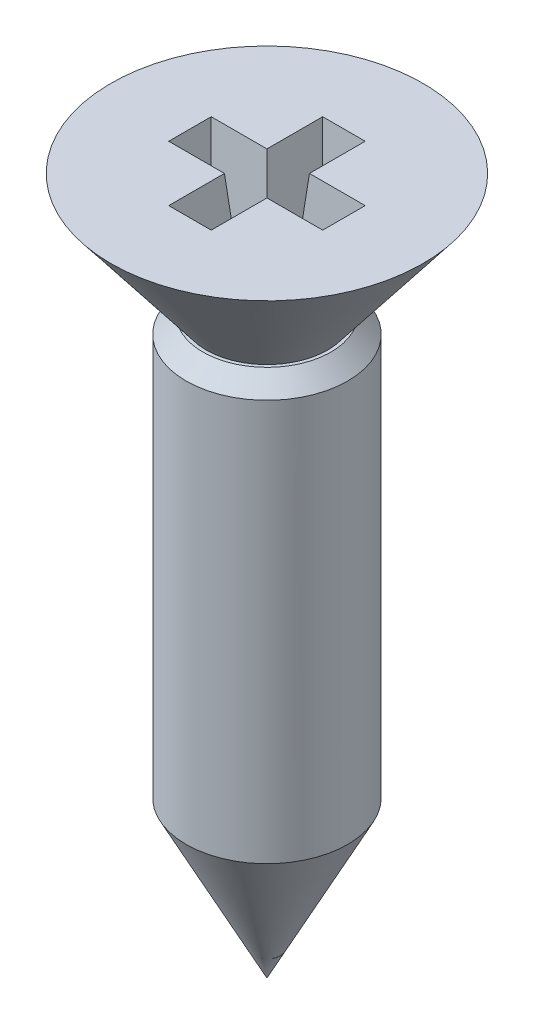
ISO-10303-21;
HEADER;
FILE_DESCRIPTION(('STEP AP214'),'2;1');
FILE_NAME('part.step','',(''),(''),'','','');
FILE_SCHEMA(('AUTOMOTIVE_DESIGN { 1 0 10303 214 1 1 1 1 }'));
ENDSEC;
DATA;
#1=APPLICATION_CONTEXT('core data for automotive mechanical design processes');
#2=APPLICATION_PROTOCOL_DEFINITION('international standard','automotive_design',2000,#1);
#3=PRODUCT_CONTEXT('',#1,'mechanical');
#4=PRODUCT('Part','Part','',(#3));
#5=PRODUCT_RELATED_PRODUCT_CATEGORY('part','',(#4));
#6=PRODUCT_DEFINITION_FORMATION('','',#4);
#7=PRODUCT_DEFINITION_CONTEXT('part definition',#1,'design');
#8=PRODUCT_DEFINITION('design','',#6,#7);
#9=PRODUCT_DEFINITION_SHAPE('','',#8);
#10=(LENGTH_UNIT() NAMED_UNIT(*) SI_UNIT(.MILLI.,.METRE.));
#11=(NAMED_UNIT(*) PLANE_ANGLE_UNIT() SI_UNIT($,.RADIAN.));
#12=(NAMED_UNIT(*) SI_UNIT($,.STERADIAN.) SOLID_ANGLE_UNIT());
#13=UNCERTAINTY_MEASURE_WITH_UNIT(LENGTH_MEASURE(1.E-05),#10,'distance_accuracy_value','');
#14=(GEOMETRIC_REPRESENTATION_CONTEXT(3) GLOBAL_UNCERTAINTY_ASSIGNED_CONTEXT((#13)) GLOBAL_UNIT_ASSIGNED_CONTEXT((#10,
#11,#12)) REPRESENTATION_CONTEXT('',''));
#15=CARTESIAN_POINT('',(0.,0.,0.));
#16=DIRECTION('',(0.,0.,1.));
#17=DIRECTION('',(1.,0.,0.));
#18=AXIS2_PLACEMENT_3D('',#15,#16,#17);
#19=CARTESIAN_POINT('',(0.,-15.9482396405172,0.));
#20=DIRECTION('',(0.,1.,0.));
#21=DIRECTION('',(0.,0.,1.));
#22=AXIS2_PLACEMENT_3D('',#19,#20,#21);
#23=CONICAL_SURFACE('',#22,0.,0.477831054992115);
#24=CARTESIAN_POINT('',(0.,-13.1482396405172,0.));
#25=DIRECTION('',(0.,1.,0.));
#26=DIRECTION('',(0.,0.,1.));
#27=AXIS2_PLACEMENT_3D('',#24,#25,#26);
#28=CIRCLE('',#27,1.45);
#29=CARTESIAN_POINT('',(0.,-13.1482396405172,1.45));
#30=VERTEX_POINT('',#29);
#31=EDGE_CURVE('E192',#30,#30,#28,.T.);
#32=ORIENTED_EDGE('',*,*,#31,.F.);
#33=EDGE_LOOP('',(#32));
#34=FACE_BOUND('',#33,.T.);
#35=CARTESIAN_POINT('',(0.,-15.9482396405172,0.));
#36=VERTEX_POINT('',#35);
#37=VERTEX_LOOP('',#36);
#38=FACE_BOUND('',#37,.T.);
#39=ADVANCED_FACE('F26',(#34,#38),#23,.T.);
#40=CARTESIAN_POINT('',(0.,0.,0.));
#41=DIRECTION('',(0.,1.,0.));
#42=DIRECTION('',(0.,0.,1.));
#43=AXIS2_PLACEMENT_3D('',#40,#41,#42);
#44=CYLINDRICAL_SURFACE('',#43,1.45);
#45=CARTESIAN_POINT('',(0.,-5.94823964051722,0.));
#46=DIRECTION('',(0.,-1.,0.));
#47=DIRECTION('',(0.,0.,-1.));
#48=AXIS2_PLACEMENT_3D('',#45,#46,#47);
#49=CIRCLE('',#48,1.45);
#50=CARTESIAN_POINT('',(0.,-5.94823964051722,-1.45));
#51=VERTEX_POINT('',#50);
#52=EDGE_CURVE('E11',#51,#51,#49,.T.);
#53=ORIENTED_EDGE('',*,*,#52,.T.);
#54=EDGE_LOOP('',(#53));
#55=FACE_BOUND('',#54,.T.);
#56=ORIENTED_EDGE('',*,*,#31,.T.);
#57=EDGE_LOOP('',(#56));
#58=FACE_BOUND('',#57,.T.);
#59=ADVANCED_FACE('F276',(#55,#58),#44,.T.);
#60=CARTESIAN_POINT('',(1.09,-5.64823964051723,0.));
#61=DIRECTION('',(0.,-1.,0.));
#62=DIRECTION('',(0.,0.,-1.));
#63=AXIS2_PLACEMENT_3D('',#60,#61,#62);
#64=PLANE('',#63);
#65=CARTESIAN_POINT('',(0.,-5.64823964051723,0.));
#66=DIRECTION('',(0.,-1.,0.));
#67=DIRECTION('',(0.,0.,-1.));
#68=AXIS2_PLACEMENT_3D('',#65,#66,#67);
#69=CIRCLE('',#68,1.15000000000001);
#70=CARTESIAN_POINT('',(0.,-5.64823964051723,-1.15000000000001));
#71=VERTEX_POINT('',#70);
#72=EDGE_CURVE('E36',#71,#71,#69,.F.);
#73=ORIENTED_EDGE('',*,*,#72,.T.);
#74=EDGE_LOOP('',(#73));
#75=FACE_BOUND('',#74,.T.);
#76=CARTESIAN_POINT('',(0.,-5.64823964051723,0.));
#77=DIRECTION('',(0.,1.,0.));
#78=DIRECTION('',(0.,0.,1.));
#79=AXIS2_PLACEMENT_3D('',#76,#77,#78);
#80=CIRCLE('',#79,1.09);
#81=CARTESIAN_POINT('',(0.,-5.64823964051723,1.09));
#82=VERTEX_POINT('',#81);
#83=EDGE_CURVE('E195',#82,#82,#80,.T.);
#84=ORIENTED_EDGE('',*,*,#83,.F.);
#85=EDGE_LOOP('',(#84));
#86=FACE_BOUND('',#85,.T.);
#87=ADVANCED_FACE('F283',(#75,#86),#64,.F.);
#88=CARTESIAN_POINT('',(0.,-5.64823964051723,0.));
#89=DIRECTION('',(0.,1.,0.));
#90=DIRECTION('',(0.,0.,1.));
#91=AXIS2_PLACEMENT_3D('',#88,#89,#90);
#92=CONICAL_SURFACE('',#91,1.09,0.66072840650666);
#93=CARTESIAN_POINT('',(0.,-3.44823964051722,0.));
#94=DIRECTION('',(0.,1.,0.));
#95=DIRECTION('',(0.,0.,1.));
#96=AXIS2_PLACEMENT_3D('',#93,#94,#95);
#97=CIRCLE('',#96,2.8);
#98=CARTESIAN_POINT('',(0.,-3.44823964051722,2.8));
#99=VERTEX_POINT('',#98);
#100=EDGE_CURVE('E182',#99,#99,#97,.T.);
#101=ORIENTED_EDGE('',*,*,#100,.F.);
#102=EDGE_LOOP('',(#101));
#103=FACE_BOUND('',#102,.T.);
#104=ORIENTED_EDGE('',*,*,#83,.T.);
#105=EDGE_LOOP('',(#104));
#106=FACE_BOUND('',#105,.T.);
#107=ADVANCED_FACE('F347',(#103,#106),#92,.T.);
#108=CARTESIAN_POINT('',(0.,-3.44823964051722,0.));
#109=DIRECTION('',(0.,-1.,0.));
#110=DIRECTION('',(0.,0.,-1.));
#111=AXIS2_PLACEMENT_3D('',#108,#109,#110);
#112=PLANE('',#111);
#113=DIRECTION('',(1.,0.,0.));
#114=VECTOR('',#113,1.);
#115=CARTESIAN_POINT('',(-1.25,-3.44823964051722,-0.381232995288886));
#116=LINE('',#115,#114);
#117=CARTESIAN_POINT('',(-0.381232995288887,-3.44823964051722,-0.381232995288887));
#118=VERTEX_POINT('',#117);
#119=CARTESIAN_POINT('',(-1.38123299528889,-3.44823964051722,-0.381232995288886));
#120=VERTEX_POINT('',#119);
#121=EDGE_CURVE('E121',#118,#120,#116,.F.);
#122=ORIENTED_EDGE('',*,*,#121,.F.);
#123=DIRECTION('',(0.,0.,-1.));
#124=VECTOR('',#123,1.);
#125=CARTESIAN_POINT('',(-0.381232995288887,-3.44823964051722,-0.250000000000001));
#126=LINE('',#125,#124);
#127=CARTESIAN_POINT('',(-0.381232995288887,-3.44823964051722,-1.38123299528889));
#128=VERTEX_POINT('',#127);
#129=EDGE_CURVE('E45',#128,#118,#126,.F.);
#130=ORIENTED_EDGE('',*,*,#129,.F.);
#131=DIRECTION('',(1.,0.,0.));
#132=VECTOR('',#131,1.);
#133=CARTESIAN_POINT('',(-0.250000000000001,-3.44823964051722,-1.38123299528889));
#134=LINE('',#133,#132);
#135=CARTESIAN_POINT('',(0.381232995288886,-3.44823964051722,-1.38123299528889));
#136=VERTEX_POINT('',#135);
#137=EDGE_CURVE('E134',#136,#128,#134,.F.);
#138=ORIENTED_EDGE('',*,*,#137,.F.);
#139=DIRECTION('',(0.,0.,1.));
#140=VECTOR('',#139,1.);
#141=CARTESIAN_POINT('',(0.381232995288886,-3.44823964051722,-1.25));
#142=LINE('',#141,#140);
#143=CARTESIAN_POINT('',(0.381232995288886,-3.44823964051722,-0.381232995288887));
#144=VERTEX_POINT('',#143);
#145=EDGE_CURVE('E138',#144,#136,#142,.F.);
#146=ORIENTED_EDGE('',*,*,#145,.F.);
#147=DIRECTION('',(1.,0.,0.));
#148=VECTOR('',#147,1.);
#149=CARTESIAN_POINT('',(0.249999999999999,-3.44823964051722,-0.381232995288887));
#150=LINE('',#149,#148);
#151=CARTESIAN_POINT('',(1.38123299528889,-3.44823964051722,-0.381232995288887));
#152=VERTEX_POINT('',#151);
#153=EDGE_CURVE('E141',#152,#144,#150,.F.);
#154=ORIENTED_EDGE('',*,*,#153,.F.);
#155=DIRECTION('',(0.,0.,1.));
#156=VECTOR('',#155,1.);
#157=CARTESIAN_POINT('',(1.38123299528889,-3.44823964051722,-0.250000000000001));
#158=LINE('',#157,#156);
#159=CARTESIAN_POINT('',(1.38123299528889,-3.44823964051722,0.381232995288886));
#160=VERTEX_POINT('',#159);
#161=EDGE_CURVE('E143',#160,#152,#158,.F.);
#162=ORIENTED_EDGE('',*,*,#161,.F.);
#163=DIRECTION('',(-1.,0.,0.));
#164=VECTOR('',#163,1.);
#165=CARTESIAN_POINT('',(1.25,-3.44823964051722,0.381232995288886));
#166=LINE('',#165,#164);
#167=CARTESIAN_POINT('',(0.381232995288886,-3.44823964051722,0.381232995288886));
#168=VERTEX_POINT('',#167);
#169=EDGE_CURVE('E30',#168,#160,#166,.F.);
#170=ORIENTED_EDGE('',*,*,#169,.F.);
#171=DIRECTION('',(0.,0.,1.));
#172=VECTOR('',#171,1.);
#173=CARTESIAN_POINT('',(0.381232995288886,-3.44823964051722,0.25));
#174=LINE('',#173,#172);
#175=CARTESIAN_POINT('',(0.381232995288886,-3.44823964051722,1.38123299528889));
#176=VERTEX_POINT('',#175);
#177=EDGE_CURVE('E147',#176,#168,#174,.F.);
#178=ORIENTED_EDGE('',*,*,#177,.F.);
#179=DIRECTION('',(-1.,0.,0.));
#180=VECTOR('',#179,1.);
#181=CARTESIAN_POINT('',(0.25,-3.44823964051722,1.38123299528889));
#182=LINE('',#181,#180);
#183=CARTESIAN_POINT('',(-0.381232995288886,-3.44823964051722,1.38123299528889));
#184=VERTEX_POINT('',#183);
#185=EDGE_CURVE('E149',#184,#176,#182,.F.);
#186=ORIENTED_EDGE('',*,*,#185,.F.);
#187=DIRECTION('',(0.,0.,-1.));
#188=VECTOR('',#187,1.);
#189=CARTESIAN_POINT('',(-0.381232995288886,-3.44823964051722,1.25));
#190=LINE('',#189,#188);
#191=CARTESIAN_POINT('',(-0.381232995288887,-3.44823964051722,0.381232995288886));
#192=VERTEX_POINT('',#191);
#193=EDGE_CURVE('E129',#192,#184,#190,.F.);
#194=ORIENTED_EDGE('',*,*,#193,.F.);
#195=DIRECTION('',(-1.,0.,0.));
#196=VECTOR('',#195,1.);
#197=CARTESIAN_POINT('',(-0.25,-3.44823964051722,0.381232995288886));
#198=LINE('',#197,#196);
#199=CARTESIAN_POINT('',(-1.38123299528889,-3.44823964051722,0.381232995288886));
#200=VERTEX_POINT('',#199);
#201=EDGE_CURVE('E127',#200,#192,#198,.F.);
#202=ORIENTED_EDGE('',*,*,#201,.F.);
#203=DIRECTION('',(0.,0.,-1.));
#204=VECTOR('',#203,1.);
#205=CARTESIAN_POINT('',(-1.38123299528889,-3.44823964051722,0.25));
#206=LINE('',#205,#204);
#207=EDGE_CURVE('E110',#120,#200,#206,.F.);
#208=ORIENTED_EDGE('',*,*,#207,.F.);
#209=EDGE_LOOP('',(#122,#130,#138,#146,#154,#162,#170,#178,#186,#194,#202,#208));
#210=FACE_BOUND('',#209,.T.);
#211=ORIENTED_EDGE('',*,*,#100,.T.);
#212=EDGE_LOOP('',(#211));
#213=FACE_BOUND('',#212,.T.);
#214=ADVANCED_FACE('F124',(#210,#213),#112,.F.);
#215=CARTESIAN_POINT('',(0.,-5.64823964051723,0.));
#216=DIRECTION('',(0.,-1.,0.));
#217=DIRECTION('',(0.,0.,-1.));
#218=AXIS2_PLACEMENT_3D('',#215,#216,#217);
#219=CONICAL_SURFACE('',#218,1.15000000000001,0.785398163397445);
#220=ORIENTED_EDGE('',*,*,#52,.F.);
#221=EDGE_LOOP('',(#220));
#222=FACE_BOUND('',#221,.T.);
#223=ORIENTED_EDGE('',*,*,#72,.F.);
#224=EDGE_LOOP('',(#223));
#225=FACE_BOUND('',#224,.T.);
#226=ADVANCED_FACE('F272',(#222,#225),#219,.T.);
#227=CARTESIAN_POINT('',(-0.25,-4.94823964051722,-0.250000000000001));
#228=DIRECTION('',(0.996194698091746,0.0871557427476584,0.));
#229=DIRECTION('',(-0.0871557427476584,0.996194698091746,0.));
#230=AXIS2_PLACEMENT_3D('',#227,#228,#229);
#231=PLANE('',#230);
#232=ORIENTED_EDGE('',*,*,#129,.T.);
#233=DIRECTION('',(-0.0868265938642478,0.992432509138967,-0.0868265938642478));
#234=VECTOR('',#233,1.);
#235=CARTESIAN_POINT('',(-0.257538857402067,-4.86207010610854,-0.257538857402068));
#236=LINE('',#235,#234);
#237=CARTESIAN_POINT('',(-0.25,-4.94823964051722,-0.250000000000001));
#238=VERTEX_POINT('',#237);
#239=EDGE_CURVE('E118',#238,#118,#236,.T.);
#240=ORIENTED_EDGE('',*,*,#239,.F.);
#241=DIRECTION('',(0.,0.,1.));
#242=VECTOR('',#241,1.);
#243=CARTESIAN_POINT('',(-0.25,-4.94823964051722,-0.250000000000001));
#244=LINE('',#243,#242);
#245=CARTESIAN_POINT('',(-0.250000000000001,-4.94823964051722,-1.25));
#246=VERTEX_POINT('',#245);
#247=EDGE_CURVE('E137',#246,#238,#244,.T.);
#248=ORIENTED_EDGE('',*,*,#247,.F.);
#249=DIRECTION('',(-0.0868265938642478,0.992432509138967,-0.0868265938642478));
#250=VECTOR('',#249,1.);
#251=CARTESIAN_POINT('',(-0.250000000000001,-4.94823964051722,-1.25));
#252=LINE('',#251,#250);
#253=EDGE_CURVE('E180',#246,#128,#252,.T.);
#254=ORIENTED_EDGE('',*,*,#253,.T.);
#255=EDGE_LOOP('',(#232,#240,#248,#254));
#256=FACE_BOUND('',#255,.T.);
#257=ADVANCED_FACE('F232',(#256),#231,.T.);
#258=CARTESIAN_POINT('',(-0.250000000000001,-4.94823964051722,-1.25));
#259=DIRECTION('',(0.,0.0871557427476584,0.996194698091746));
#260=DIRECTION('',(0.,-0.996194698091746,0.0871557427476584));
#261=AXIS2_PLACEMENT_3D('',#258,#259,#260);
#262=PLANE('',#261);
#263=ORIENTED_EDGE('',*,*,#137,.T.);
#264=ORIENTED_EDGE('',*,*,#253,.F.);
#265=DIRECTION('',(-1.,0.,0.));
#266=VECTOR('',#265,1.);
#267=CARTESIAN_POINT('',(-0.250000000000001,-4.94823964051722,-1.25));
#268=LINE('',#267,#266);
#269=CARTESIAN_POINT('',(0.249999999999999,-4.94823964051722,-1.25));
#270=VERTEX_POINT('',#269);
#271=EDGE_CURVE('E179',#270,#246,#268,.T.);
#272=ORIENTED_EDGE('',*,*,#271,.F.);
#273=DIRECTION('',(0.0868265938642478,0.992432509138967,-0.0868265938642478));
#274=VECTOR('',#273,1.);
#275=CARTESIAN_POINT('',(0.249999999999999,-4.94823964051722,-1.25));
#276=LINE('',#275,#274);
#277=EDGE_CURVE('E183',#270,#136,#276,.T.);
#278=ORIENTED_EDGE('',*,*,#277,.T.);
#279=EDGE_LOOP('',(#263,#264,#272,#278));
#280=FACE_BOUND('',#279,.T.);
#281=ADVANCED_FACE('F264',(#280),#262,.T.);
#282=CARTESIAN_POINT('',(0.249999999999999,-4.94823964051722,-1.25));
#283=DIRECTION('',(-0.996194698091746,0.0871557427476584,0.));
#284=DIRECTION('',(-0.0871557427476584,-0.996194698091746,0.));
#285=AXIS2_PLACEMENT_3D('',#282,#283,#284);
#286=PLANE('',#285);
#287=ORIENTED_EDGE('',*,*,#145,.T.);
#288=ORIENTED_EDGE('',*,*,#277,.F.);
#289=DIRECTION('',(0.,0.,-1.));
#290=VECTOR('',#289,1.);
#291=CARTESIAN_POINT('',(0.249999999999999,-4.94823964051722,-1.25));
#292=LINE('',#291,#290);
#293=CARTESIAN_POINT('',(0.249999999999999,-4.94823964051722,-0.250000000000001));
#294=VERTEX_POINT('',#293);
#295=EDGE_CURVE('E202',#294,#270,#292,.T.);
#296=ORIENTED_EDGE('',*,*,#295,.F.);
#297=DIRECTION('',(0.0868265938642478,0.992432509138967,-0.0868265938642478));
#298=VECTOR('',#297,1.);
#299=CARTESIAN_POINT('',(0.257538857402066,-4.86207010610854,-0.257538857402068));
#300=LINE('',#299,#298);
#301=EDGE_CURVE('E185',#294,#144,#300,.T.);
#302=ORIENTED_EDGE('',*,*,#301,.T.);
#303=EDGE_LOOP('',(#287,#288,#296,#302));
#304=FACE_BOUND('',#303,.T.);
#305=ADVANCED_FACE('F262',(#304),#286,.T.);
#306=CARTESIAN_POINT('',(0.249999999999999,-4.94823964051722,-0.250000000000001));
#307=DIRECTION('',(0.,0.0871557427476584,0.996194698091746));
#308=DIRECTION('',(0.,-0.996194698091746,0.0871557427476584));
#309=AXIS2_PLACEMENT_3D('',#306,#307,#308);
#310=PLANE('',#309);
#311=ORIENTED_EDGE('',*,*,#153,.T.);
#312=ORIENTED_EDGE('',*,*,#301,.F.);
#313=DIRECTION('',(-1.,0.,0.));
#314=VECTOR('',#313,1.);
#315=CARTESIAN_POINT('',(0.249999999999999,-4.94823964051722,-0.250000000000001));
#316=LINE('',#315,#314);
#317=CARTESIAN_POINT('',(1.25,-4.94823964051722,-0.250000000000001));
#318=VERTEX_POINT('',#317);
#319=EDGE_CURVE('E205',#318,#294,#316,.T.);
#320=ORIENTED_EDGE('',*,*,#319,.F.);
#321=DIRECTION('',(0.0868265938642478,0.992432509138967,-0.0868265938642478));
#322=VECTOR('',#321,1.);
#323=CARTESIAN_POINT('',(1.25,-4.94823964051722,-0.250000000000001));
#324=LINE('',#323,#322);
#325=EDGE_CURVE('E186',#318,#152,#324,.T.);
#326=ORIENTED_EDGE('',*,*,#325,.T.);
#327=EDGE_LOOP('',(#311,#312,#320,#326));
#328=FACE_BOUND('',#327,.T.);
#329=ADVANCED_FACE('F259',(#328),#310,.T.);
#330=CARTESIAN_POINT('',(1.25,-4.94823964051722,-0.250000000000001));
#331=DIRECTION('',(-0.996194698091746,0.0871557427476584,0.));
#332=DIRECTION('',(-0.0871557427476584,-0.996194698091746,0.));
#333=AXIS2_PLACEMENT_3D('',#330,#331,#332);
#334=PLANE('',#333);
#335=ORIENTED_EDGE('',*,*,#161,.T.);
#336=ORIENTED_EDGE('',*,*,#325,.F.);
#337=DIRECTION('',(0.,0.,-1.));
#338=VECTOR('',#337,1.);
#339=CARTESIAN_POINT('',(1.25,-4.94823964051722,-0.250000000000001));
#340=LINE('',#339,#338);
#341=CARTESIAN_POINT('',(1.25,-4.94823964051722,0.249999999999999));
#342=VERTEX_POINT('',#341);
#343=EDGE_CURVE('E208',#342,#318,#340,.T.);
#344=ORIENTED_EDGE('',*,*,#343,.F.);
#345=DIRECTION('',(0.0868265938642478,0.992432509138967,0.0868265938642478));
#346=VECTOR('',#345,1.);
#347=CARTESIAN_POINT('',(1.25,-4.94823964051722,0.249999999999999));
#348=LINE('',#347,#346);
#349=EDGE_CURVE('E71',#342,#160,#348,.T.);
#350=ORIENTED_EDGE('',*,*,#349,.T.);
#351=EDGE_LOOP('',(#335,#336,#344,#350));
#352=FACE_BOUND('',#351,.T.);
#353=ADVANCED_FACE('F257',(#352),#334,.T.);
#354=CARTESIAN_POINT('',(1.25,-4.94823964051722,0.249999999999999));
#355=DIRECTION('',(0.,0.0871557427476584,-0.996194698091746));
#356=DIRECTION('',(0.,0.996194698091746,0.0871557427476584));
#357=AXIS2_PLACEMENT_3D('',#354,#355,#356);
#358=PLANE('',#357);
#359=ORIENTED_EDGE('',*,*,#169,.T.);
#360=ORIENTED_EDGE('',*,*,#349,.F.);
#361=DIRECTION('',(1.,0.,0.));
#362=VECTOR('',#361,1.);
#363=CARTESIAN_POINT('',(1.25,-4.94823964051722,0.249999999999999));
#364=LINE('',#363,#362);
#365=CARTESIAN_POINT('',(0.25,-4.94823964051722,0.25));
#366=VERTEX_POINT('',#365);
#367=EDGE_CURVE('E211',#366,#342,#364,.T.);
#368=ORIENTED_EDGE('',*,*,#367,.F.);
#369=DIRECTION('',(0.0868265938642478,0.992432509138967,0.0868265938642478));
#370=VECTOR('',#369,1.);
#371=CARTESIAN_POINT('',(0.257538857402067,-4.86207010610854,0.257538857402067));
#372=LINE('',#371,#370);
#373=EDGE_CURVE('E78',#366,#168,#372,.T.);
#374=ORIENTED_EDGE('',*,*,#373,.T.);
#375=EDGE_LOOP('',(#359,#360,#368,#374));
#376=FACE_BOUND('',#375,.T.);
#377=ADVANCED_FACE('F256',(#376),#358,.T.);
#378=CARTESIAN_POINT('',(0.25,-4.94823964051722,0.25));
#379=DIRECTION('',(-0.996194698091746,0.0871557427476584,0.));
#380=DIRECTION('',(-0.0871557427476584,-0.996194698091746,0.));
#381=AXIS2_PLACEMENT_3D('',#378,#379,#380);
#382=PLANE('',#381);
#383=ORIENTED_EDGE('',*,*,#177,.T.);
#384=ORIENTED_EDGE('',*,*,#373,.F.);
#385=DIRECTION('',(0.,0.,-1.));
#386=VECTOR('',#385,1.);
#387=CARTESIAN_POINT('',(0.25,-4.94823964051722,0.25));
#388=LINE('',#387,#386);
#389=CARTESIAN_POINT('',(0.25,-4.94823964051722,1.25));
#390=VERTEX_POINT('',#389);
#391=EDGE_CURVE('E214',#390,#366,#388,.T.);
#392=ORIENTED_EDGE('',*,*,#391,.F.);
#393=DIRECTION('',(0.0868265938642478,0.992432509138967,0.0868265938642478));
#394=VECTOR('',#393,1.);
#395=CARTESIAN_POINT('',(0.25,-4.94823964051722,1.25));
#396=LINE('',#395,#394);
#397=EDGE_CURVE('E86',#390,#176,#396,.T.);
#398=ORIENTED_EDGE('',*,*,#397,.T.);
#399=EDGE_LOOP('',(#383,#384,#392,#398));
#400=FACE_BOUND('',#399,.T.);
#401=ADVANCED_FACE('F255',(#400),#382,.T.);
#402=CARTESIAN_POINT('',(0.25,-4.94823964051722,1.25));
#403=DIRECTION('',(0.,0.0871557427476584,-0.996194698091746));
#404=DIRECTION('',(0.,0.996194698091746,0.0871557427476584));
#405=AXIS2_PLACEMENT_3D('',#402,#403,#404);
#406=PLANE('',#405);
#407=ORIENTED_EDGE('',*,*,#185,.T.);
#408=ORIENTED_EDGE('',*,*,#397,.F.);
#409=DIRECTION('',(1.,0.,0.));
#410=VECTOR('',#409,1.);
#411=CARTESIAN_POINT('',(0.25,-4.94823964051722,1.25));
#412=LINE('',#411,#410);
#413=CARTESIAN_POINT('',(-0.25,-4.94823964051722,1.25));
#414=VERTEX_POINT('',#413);
#415=EDGE_CURVE('E170',#414,#390,#412,.T.);
#416=ORIENTED_EDGE('',*,*,#415,.F.);
#417=DIRECTION('',(-0.0868265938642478,0.992432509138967,0.0868265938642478));
#418=VECTOR('',#417,1.);
#419=CARTESIAN_POINT('',(-0.25,-4.94823964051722,1.25));
#420=LINE('',#419,#418);
#421=EDGE_CURVE('E162',#414,#184,#420,.T.);
#422=ORIENTED_EDGE('',*,*,#421,.T.);
#423=EDGE_LOOP('',(#407,#408,#416,#422));
#424=FACE_BOUND('',#423,.T.);
#425=ADVANCED_FACE('F167',(#424),#406,.T.);
#426=CARTESIAN_POINT('',(-0.25,-4.94823964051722,1.25));
#427=DIRECTION('',(0.996194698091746,0.0871557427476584,0.));
#428=DIRECTION('',(-0.0871557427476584,0.996194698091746,0.));
#429=AXIS2_PLACEMENT_3D('',#426,#427,#428);
#430=PLANE('',#429);
#431=ORIENTED_EDGE('',*,*,#193,.T.);
#432=ORIENTED_EDGE('',*,*,#421,.F.);
#433=DIRECTION('',(0.,0.,1.));
#434=VECTOR('',#433,1.);
#435=CARTESIAN_POINT('',(-0.25,-4.94823964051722,1.25));
#436=LINE('',#435,#434);
#437=CARTESIAN_POINT('',(-0.25,-4.94823964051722,0.25));
#438=VERTEX_POINT('',#437);
#439=EDGE_CURVE('E218',#438,#414,#436,.T.);
#440=ORIENTED_EDGE('',*,*,#439,.F.);
#441=DIRECTION('',(-0.0868265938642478,0.992432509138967,0.0868265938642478));
#442=VECTOR('',#441,1.);
#443=CARTESIAN_POINT('',(-0.257538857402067,-4.86207010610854,0.257538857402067));
#444=LINE('',#443,#442);
#445=EDGE_CURVE('E165',#438,#192,#444,.T.);
#446=ORIENTED_EDGE('',*,*,#445,.T.);
#447=EDGE_LOOP('',(#431,#432,#440,#446));
#448=FACE_BOUND('',#447,.T.);
#449=ADVANCED_FACE('F159',(#448),#430,.T.);
#450=CARTESIAN_POINT('',(-0.25,-4.94823964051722,0.25));
#451=DIRECTION('',(0.,0.0871557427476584,-0.996194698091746));
#452=DIRECTION('',(0.,0.996194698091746,0.0871557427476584));
#453=AXIS2_PLACEMENT_3D('',#450,#451,#452);
#454=PLANE('',#453);
#455=ORIENTED_EDGE('',*,*,#201,.T.);
#456=ORIENTED_EDGE('',*,*,#445,.F.);
#457=DIRECTION('',(1.,0.,0.));
#458=VECTOR('',#457,1.);
#459=CARTESIAN_POINT('',(-0.25,-4.94823964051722,0.25));
#460=LINE('',#459,#458);
#461=CARTESIAN_POINT('',(-1.25,-4.94823964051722,0.25));
#462=VERTEX_POINT('',#461);
#463=EDGE_CURVE('E220',#462,#438,#460,.T.);
#464=ORIENTED_EDGE('',*,*,#463,.F.);
#465=DIRECTION('',(-0.0868265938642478,0.992432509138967,0.0868265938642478));
#466=VECTOR('',#465,1.);
#467=CARTESIAN_POINT('',(-1.25,-4.94823964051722,0.25));
#468=LINE('',#467,#466);
#469=EDGE_CURVE('E100',#462,#200,#468,.T.);
#470=ORIENTED_EDGE('',*,*,#469,.T.);
#471=EDGE_LOOP('',(#455,#456,#464,#470));
#472=FACE_BOUND('',#471,.T.);
#473=ADVANCED_FACE('F254',(#472),#454,.T.);
#474=CARTESIAN_POINT('',(-1.25,-4.94823964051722,0.25));
#475=DIRECTION('',(0.996194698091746,0.0871557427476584,0.));
#476=DIRECTION('',(-0.0871557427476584,0.996194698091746,0.));
#477=AXIS2_PLACEMENT_3D('',#474,#475,#476);
#478=PLANE('',#477);
#479=ORIENTED_EDGE('',*,*,#207,.T.);
#480=ORIENTED_EDGE('',*,*,#469,.F.);
#481=DIRECTION('',(0.,0.,1.));
#482=VECTOR('',#481,1.);
#483=CARTESIAN_POINT('',(-1.25,-4.94823964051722,0.25));
#484=LINE('',#483,#482);
#485=CARTESIAN_POINT('',(-1.25,-4.94823964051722,-0.25));
#486=VERTEX_POINT('',#485);
#487=EDGE_CURVE('E114',#486,#462,#484,.T.);
#488=ORIENTED_EDGE('',*,*,#487,.F.);
#489=DIRECTION('',(-0.0868265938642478,0.992432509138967,-0.0868265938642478));
#490=VECTOR('',#489,1.);
#491=CARTESIAN_POINT('',(-1.25,-4.94823964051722,-0.25));
#492=LINE('',#491,#490);
#493=EDGE_CURVE('E106',#486,#120,#492,.T.);
#494=ORIENTED_EDGE('',*,*,#493,.T.);
#495=EDGE_LOOP('',(#479,#480,#488,#494));
#496=FACE_BOUND('',#495,.T.);
#497=ADVANCED_FACE('F108',(#496),#478,.T.);
#498=CARTESIAN_POINT('',(-1.25,-4.94823964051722,-0.25));
#499=DIRECTION('',(0.,0.0871557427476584,0.996194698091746));
#500=DIRECTION('',(0.,-0.996194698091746,0.0871557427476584));
#501=AXIS2_PLACEMENT_3D('',#498,#499,#500);
#502=PLANE('',#501);
#503=ORIENTED_EDGE('',*,*,#121,.T.);
#504=ORIENTED_EDGE('',*,*,#493,.F.);
#505=DIRECTION('',(-1.,0.,0.));
#506=VECTOR('',#505,1.);
#507=CARTESIAN_POINT('',(-1.25,-4.94823964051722,-0.25));
#508=LINE('',#507,#506);
#509=EDGE_CURVE('E224',#238,#486,#508,.T.);
#510=ORIENTED_EDGE('',*,*,#509,.F.);
#511=ORIENTED_EDGE('',*,*,#239,.T.);
#512=EDGE_LOOP('',(#503,#504,#510,#511));
#513=FACE_BOUND('',#512,.T.);
#514=ADVANCED_FACE('F28',(#513),#502,.T.);
#515=CARTESIAN_POINT('',(-0.25,-4.94823964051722,0.25));
#516=DIRECTION('',(0.,1.,0.));
#517=DIRECTION('',(0.,0.,1.));
#518=AXIS2_PLACEMENT_3D('',#515,#516,#517);
#519=PLANE('',#518);
#520=ORIENTED_EDGE('',*,*,#247,.T.);
#521=ORIENTED_EDGE('',*,*,#509,.T.);
#522=ORIENTED_EDGE('',*,*,#487,.T.);
#523=ORIENTED_EDGE('',*,*,#463,.T.);
#524=ORIENTED_EDGE('',*,*,#439,.T.);
#525=ORIENTED_EDGE('',*,*,#415,.T.);
#526=ORIENTED_EDGE('',*,*,#391,.T.);
#527=ORIENTED_EDGE('',*,*,#367,.T.);
#528=ORIENTED_EDGE('',*,*,#343,.T.);
#529=ORIENTED_EDGE('',*,*,#319,.T.);
#530=ORIENTED_EDGE('',*,*,#295,.T.);
#531=ORIENTED_EDGE('',*,*,#271,.T.);
#532=EDGE_LOOP('',(#520,#521,#522,#523,#524,#525,#526,#527,#528,#529,#530,#531));
#533=FACE_BOUND('',#532,.T.);
#534=ADVANCED_FACE('F229',(#533),#519,.T.);
#535=CLOSED_SHELL('',(#39,#59,#87,#107,#214,#226,#257,#281,#305,#329,#353,#377,#401,#425,#449,
#473,#497,#514,#534));
#536=MANIFOLD_SOLID_BREP('B2',#535);
#537=ADVANCED_BREP_SHAPE_REPRESENTATION('',(#18,#536),#14);
#538=SHAPE_DEFINITION_REPRESENTATION(#9,#537);
ENDSEC;
END-ISO-10303-21;
